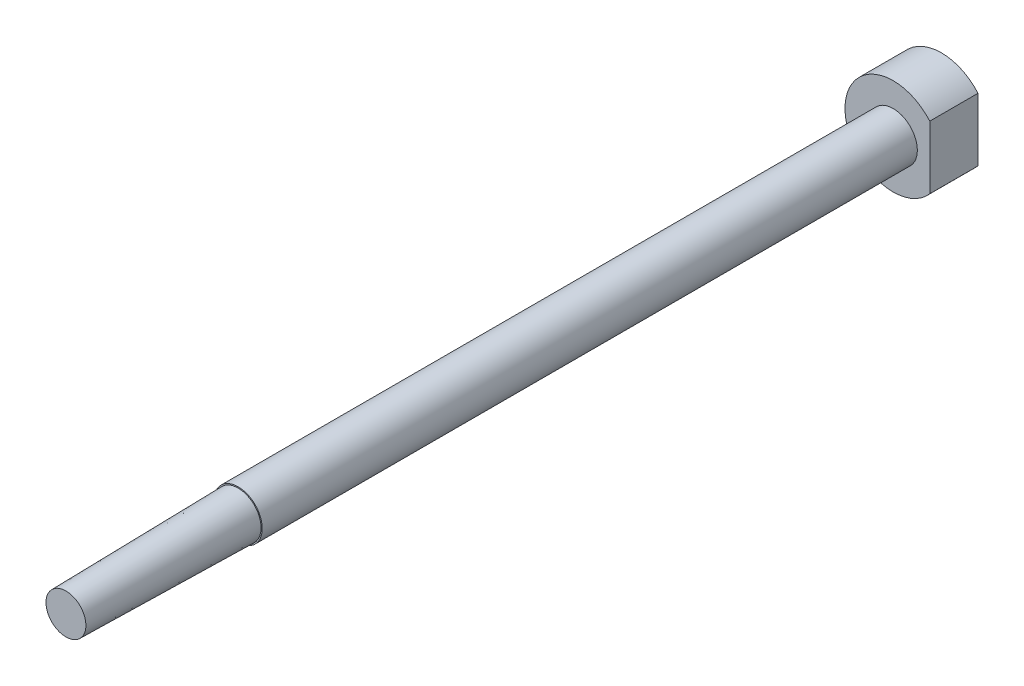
ISO-10303-21;
HEADER;
FILE_DESCRIPTION(('STEP AP214'),'2;1');
FILE_NAME('part.step','',(''),(''),'','','');
FILE_SCHEMA(('AUTOMOTIVE_DESIGN { 1 0 10303 214 1 1 1 1 }'));
ENDSEC;
DATA;
#1=APPLICATION_CONTEXT('core data for automotive mechanical design processes');
#2=APPLICATION_PROTOCOL_DEFINITION('international standard','automotive_design',2000,#1);
#3=PRODUCT_CONTEXT('',#1,'mechanical');
#4=PRODUCT('Part','Part','',(#3));
#5=PRODUCT_RELATED_PRODUCT_CATEGORY('part','',(#4));
#6=PRODUCT_DEFINITION_FORMATION('','',#4);
#7=PRODUCT_DEFINITION_CONTEXT('part definition',#1,'design');
#8=PRODUCT_DEFINITION('design','',#6,#7);
#9=PRODUCT_DEFINITION_SHAPE('','',#8);
#10=(LENGTH_UNIT() NAMED_UNIT(*) SI_UNIT(.MILLI.,.METRE.));
#11=(NAMED_UNIT(*) PLANE_ANGLE_UNIT() SI_UNIT($,.RADIAN.));
#12=(NAMED_UNIT(*) SI_UNIT($,.STERADIAN.) SOLID_ANGLE_UNIT());
#13=UNCERTAINTY_MEASURE_WITH_UNIT(LENGTH_MEASURE(1.E-05),#10,'distance_accuracy_value','');
#14=(GEOMETRIC_REPRESENTATION_CONTEXT(3) GLOBAL_UNCERTAINTY_ASSIGNED_CONTEXT((#13)) GLOBAL_UNIT_ASSIGNED_CONTEXT((#10,
#11,#12)) REPRESENTATION_CONTEXT('',''));
#15=CARTESIAN_POINT('',(0.,0.,0.));
#16=DIRECTION('',(0.,0.,1.));
#17=DIRECTION('',(1.,0.,0.));
#18=AXIS2_PLACEMENT_3D('',#15,#16,#17);
#19=CARTESIAN_POINT('',(89.25,50.745,-53.));
#20=DIRECTION('',(0.,0.,-1.));
#21=DIRECTION('',(-1.,0.,0.));
#22=AXIS2_PLACEMENT_3D('',#19,#20,#21);
#23=PLANE('',#22);
#24=CARTESIAN_POINT('',(89.25,50.745,-53.));
#25=DIRECTION('',(0.,0.,-1.));
#26=DIRECTION('',(-1.,0.,0.));
#27=AXIS2_PLACEMENT_3D('',#24,#25,#26);
#28=CIRCLE('',#27,1.5);
#29=CARTESIAN_POINT('',(87.75,50.745,-53.));
#30=VERTEX_POINT('',#29);
#31=EDGE_CURVE('E24',#30,#30,#28,.T.);
#32=ORIENTED_EDGE('',*,*,#31,.T.);
#33=EDGE_LOOP('',(#32));
#34=FACE_BOUND('',#33,.T.);
#35=DIRECTION('',(0.,-1.,0.));
#36=VECTOR('',#35,1.);
#37=CARTESIAN_POINT('',(91.5238680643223,50.745,-53.));
#38=LINE('',#37,#36);
#39=CARTESIAN_POINT('',(91.5238680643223,52.7019169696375,-53.));
#40=VERTEX_POINT('',#39);
#41=CARTESIAN_POINT('',(91.5238680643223,48.7880830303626,-53.));
#42=VERTEX_POINT('',#41);
#43=EDGE_CURVE('E35',#40,#42,#38,.T.);
#44=ORIENTED_EDGE('',*,*,#43,.F.);
#45=CARTESIAN_POINT('',(89.25,50.745,-53.));
#46=DIRECTION('',(0.,0.,-1.));
#47=DIRECTION('',(1.,0.,0.));
#48=AXIS2_PLACEMENT_3D('',#45,#46,#47);
#49=CIRCLE('',#48,3.);
#50=EDGE_CURVE('E50',#42,#40,#49,.T.);
#51=ORIENTED_EDGE('',*,*,#50,.F.);
#52=EDGE_LOOP('',(#44,#51));
#53=FACE_BOUND('',#52,.T.);
#54=ADVANCED_FACE('F16',(#34,#53),#23,.F.);
#55=CARTESIAN_POINT('',(89.25,50.745,-53.));
#56=DIRECTION('',(0.,0.,-1.));
#57=DIRECTION('',(-1.,0.,0.));
#58=AXIS2_PLACEMENT_3D('',#55,#56,#57);
#59=CYLINDRICAL_SURFACE('',#58,3.);
#60=CARTESIAN_POINT('',(89.25,50.745,-56.));
#61=DIRECTION('',(0.,0.,-1.));
#62=DIRECTION('',(1.,0.,0.));
#63=AXIS2_PLACEMENT_3D('',#60,#61,#62);
#64=CIRCLE('',#63,3.);
#65=CARTESIAN_POINT('',(91.5238680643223,48.7880830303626,-56.));
#66=VERTEX_POINT('',#65);
#67=CARTESIAN_POINT('',(91.5238680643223,52.7019169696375,-56.));
#68=VERTEX_POINT('',#67);
#69=EDGE_CURVE('E48',#66,#68,#64,.T.);
#70=ORIENTED_EDGE('',*,*,#69,.F.);
#71=DIRECTION('',(0.,0.,-1.));
#72=VECTOR('',#71,1.);
#73=CARTESIAN_POINT('',(91.5238680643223,48.7880830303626,-53.));
#74=LINE('',#73,#72);
#75=EDGE_CURVE('E31',#66,#42,#74,.F.);
#76=ORIENTED_EDGE('',*,*,#75,.T.);
#77=ORIENTED_EDGE('',*,*,#50,.T.);
#78=DIRECTION('',(0.,0.,-1.));
#79=VECTOR('',#78,1.);
#80=CARTESIAN_POINT('',(91.5238680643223,52.7019169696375,-53.));
#81=LINE('',#80,#79);
#82=EDGE_CURVE('E41',#40,#68,#81,.T.);
#83=ORIENTED_EDGE('',*,*,#82,.T.);
#84=EDGE_LOOP('',(#70,#76,#77,#83));
#85=FACE_BOUND('',#84,.T.);
#86=ADVANCED_FACE('F47',(#85),#59,.T.);
#87=CARTESIAN_POINT('',(0.,51.0956758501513,-56.));
#88=DIRECTION('',(0.,0.,-1.));
#89=DIRECTION('',(-1.,0.,0.));
#90=AXIS2_PLACEMENT_3D('',#87,#88,#89);
#91=PLANE('',#90);
#92=ORIENTED_EDGE('',*,*,#69,.T.);
#93=DIRECTION('',(0.,-1.,0.));
#94=VECTOR('',#93,1.);
#95=CARTESIAN_POINT('',(91.5238680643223,51.0956758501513,-56.));
#96=LINE('',#95,#94);
#97=EDGE_CURVE('E11',#68,#66,#96,.T.);
#98=ORIENTED_EDGE('',*,*,#97,.T.);
#99=EDGE_LOOP('',(#92,#98));
#100=FACE_BOUND('',#99,.T.);
#101=ADVANCED_FACE('F18',(#100),#91,.T.);
#102=CARTESIAN_POINT('',(89.25,50.745,-130.249188));
#103=DIRECTION('',(0.,0.,1.));
#104=DIRECTION('',(1.,0.,0.));
#105=AXIS2_PLACEMENT_3D('',#102,#103,#104);
#106=CYLINDRICAL_SURFACE('',#105,1.5);
#107=CARTESIAN_POINT('',(89.25,50.745,-12.249188));
#108=DIRECTION('',(0.,0.,-1.));
#109=DIRECTION('',(1.,0.,0.));
#110=AXIS2_PLACEMENT_3D('',#107,#108,#109);
#111=CIRCLE('',#110,1.5);
#112=CARTESIAN_POINT('',(90.75,50.745,-12.249188));
#113=VERTEX_POINT('',#112);
#114=EDGE_CURVE('E53',#113,#113,#111,.T.);
#115=ORIENTED_EDGE('',*,*,#114,.T.);
#116=EDGE_LOOP('',(#115));
#117=FACE_BOUND('',#116,.T.);
#118=ORIENTED_EDGE('',*,*,#31,.F.);
#119=EDGE_LOOP('',(#118));
#120=FACE_BOUND('',#119,.T.);
#121=ADVANCED_FACE('F69',(#117,#120),#106,.T.);
#122=CARTESIAN_POINT('',(89.25,50.745,-12.249188));
#123=DIRECTION('',(0.,0.,-1.));
#124=DIRECTION('',(-1.,0.,0.));
#125=AXIS2_PLACEMENT_3D('',#122,#123,#124);
#126=PLANE('',#125);
#127=CARTESIAN_POINT('',(89.25,50.745,-12.249188));
#128=DIRECTION('',(0.,0.,-1.));
#129=DIRECTION('',(-1.,0.,0.));
#130=AXIS2_PLACEMENT_3D('',#127,#128,#129);
#131=CIRCLE('',#130,1.428);
#132=CARTESIAN_POINT('',(87.822,50.745,-12.249188));
#133=VERTEX_POINT('',#132);
#134=EDGE_CURVE('E59',#133,#133,#131,.T.);
#135=ORIENTED_EDGE('',*,*,#134,.T.);
#136=EDGE_LOOP('',(#135));
#137=FACE_BOUND('',#136,.T.);
#138=ORIENTED_EDGE('',*,*,#114,.F.);
#139=EDGE_LOOP('',(#138));
#140=FACE_BOUND('',#139,.T.);
#141=ADVANCED_FACE('F71',(#137,#140),#126,.F.);
#142=CARTESIAN_POINT('',(89.25,50.745,-1.539188));
#143=DIRECTION('',(0.,0.,-1.));
#144=DIRECTION('',(-1.,0.,0.));
#145=AXIS2_PLACEMENT_3D('',#142,#143,#144);
#146=PLANE('',#145);
#147=CARTESIAN_POINT('',(89.25,50.745,-1.539188));
#148=DIRECTION('',(0.,0.,-1.));
#149=DIRECTION('',(-1.,0.,0.));
#150=AXIS2_PLACEMENT_3D('',#147,#148,#149);
#151=CIRCLE('',#150,1.2410562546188);
#152=CARTESIAN_POINT('',(88.0089437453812,50.745,-1.539188));
#153=VERTEX_POINT('',#152);
#154=EDGE_CURVE('E60',#153,#153,#151,.T.);
#155=ORIENTED_EDGE('',*,*,#154,.F.);
#156=EDGE_LOOP('',(#155));
#157=FACE_BOUND('',#156,.T.);
#158=ADVANCED_FACE('F78',(#157),#146,.F.);
#159=CARTESIAN_POINT('',(89.25,50.745,-12.249188));
#160=DIRECTION('',(0.,0.,-1.));
#161=DIRECTION('',(-1.,0.,0.));
#162=AXIS2_PLACEMENT_3D('',#159,#160,#161);
#163=CONICAL_SURFACE('',#162,1.428,0.0174532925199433);
#164=ORIENTED_EDGE('',*,*,#154,.T.);
#165=EDGE_LOOP('',(#164));
#166=FACE_BOUND('',#165,.T.);
#167=ORIENTED_EDGE('',*,*,#134,.F.);
#168=EDGE_LOOP('',(#167));
#169=FACE_BOUND('',#168,.T.);
#170=ADVANCED_FACE('F90',(#166,#169),#163,.T.);
#171=CARTESIAN_POINT('',(91.5238680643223,45.6956758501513,-51.224794));
#172=DIRECTION('',(1.,0.,0.));
#173=DIRECTION('',(0.,0.,-1.));
#174=AXIS2_PLACEMENT_3D('',#171,#172,#173);
#175=PLANE('',#174);
#176=ORIENTED_EDGE('',*,*,#43,.T.);
#177=ORIENTED_EDGE('',*,*,#75,.F.);
#178=ORIENTED_EDGE('',*,*,#97,.F.);
#179=ORIENTED_EDGE('',*,*,#82,.F.);
#180=EDGE_LOOP('',(#176,#177,#178,#179));
#181=FACE_BOUND('',#180,.T.);
#182=ADVANCED_FACE('F40',(#181),#175,.T.);
#183=CLOSED_SHELL('',(#54,#86,#101,#121,#141,#158,#170,#182));
#184=MANIFOLD_SOLID_BREP('B1',#183);
#185=ADVANCED_BREP_SHAPE_REPRESENTATION('',(#18,#184),#14);
#186=SHAPE_DEFINITION_REPRESENTATION(#9,#185);
ENDSEC;
END-ISO-10303-21;
